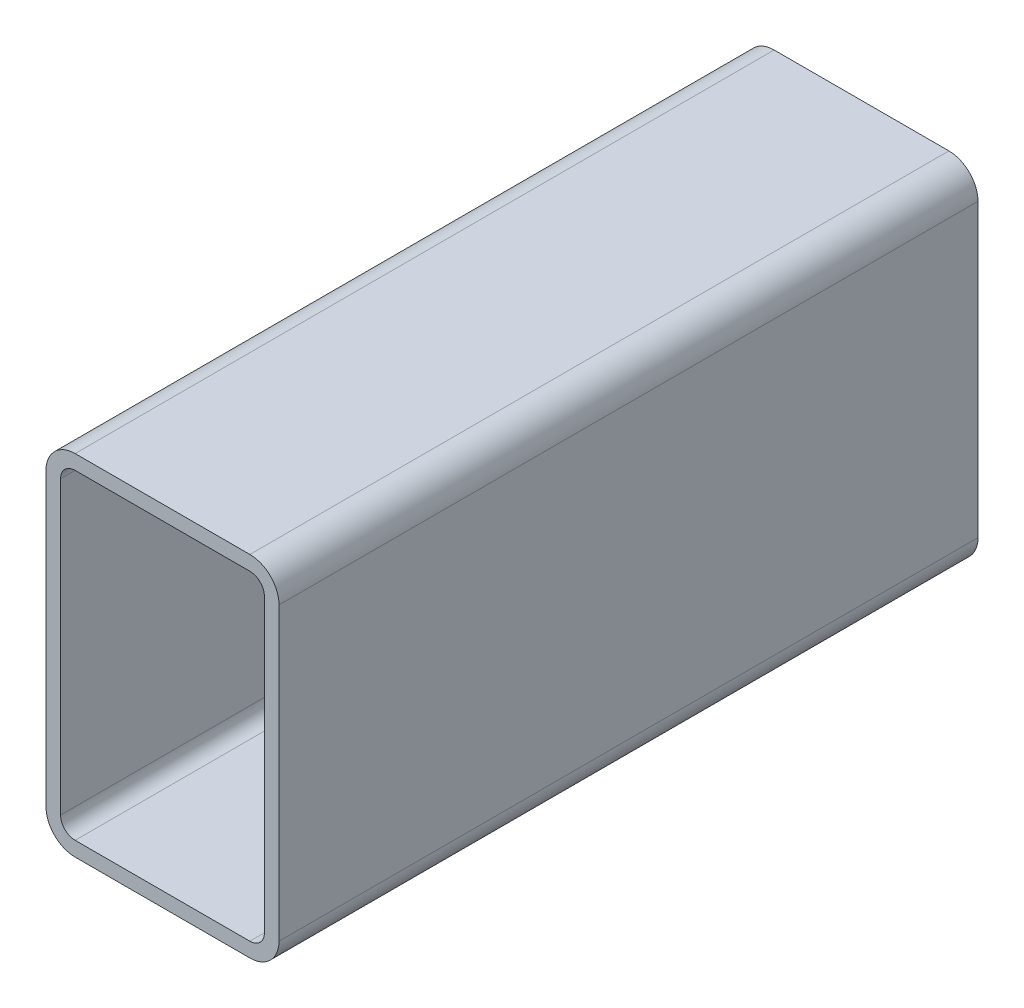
ISO-10303-21;
HEADER;
FILE_DESCRIPTION(('STEP AP214'),'2;1');
FILE_NAME('part.step','',(''),(''),'','','');
FILE_SCHEMA(('AUTOMOTIVE_DESIGN { 1 0 10303 214 1 1 1 1 }'));
ENDSEC;
DATA;
#1=APPLICATION_CONTEXT('core data for automotive mechanical design processes');
#2=APPLICATION_PROTOCOL_DEFINITION('international standard','automotive_design',2000,#1);
#3=PRODUCT_CONTEXT('',#1,'mechanical');
#4=PRODUCT('Part','Part','',(#3));
#5=PRODUCT_RELATED_PRODUCT_CATEGORY('part','',(#4));
#6=PRODUCT_DEFINITION_FORMATION('','',#4);
#7=PRODUCT_DEFINITION_CONTEXT('part definition',#1,'design');
#8=PRODUCT_DEFINITION('design','',#6,#7);
#9=PRODUCT_DEFINITION_SHAPE('','',#8);
#10=(LENGTH_UNIT() NAMED_UNIT(*) SI_UNIT(.MILLI.,.METRE.));
#11=(NAMED_UNIT(*) PLANE_ANGLE_UNIT() SI_UNIT($,.RADIAN.));
#12=(NAMED_UNIT(*) SI_UNIT($,.STERADIAN.) SOLID_ANGLE_UNIT());
#13=UNCERTAINTY_MEASURE_WITH_UNIT(LENGTH_MEASURE(1.E-05),#10,'distance_accuracy_value','');
#14=(GEOMETRIC_REPRESENTATION_CONTEXT(3) GLOBAL_UNCERTAINTY_ASSIGNED_CONTEXT((#13)) GLOBAL_UNIT_ASSIGNED_CONTEXT((#10,
#11,#12)) REPRESENTATION_CONTEXT('',''));
#15=CARTESIAN_POINT('',(0.,0.,0.));
#16=DIRECTION('',(0.,0.,1.));
#17=DIRECTION('',(1.,0.,0.));
#18=AXIS2_PLACEMENT_3D('',#15,#16,#17);
#19=CARTESIAN_POINT('',(14.3751778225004,141.711948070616,304.8));
#20=DIRECTION('',(0.,0.,1.));
#21=DIRECTION('',(1.,0.,0.));
#22=AXIS2_PLACEMENT_3D('',#19,#20,#21);
#23=PLANE('',#22);
#24=CARTESIAN_POINT('',(14.3751778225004,141.711948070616,304.8));
#25=DIRECTION('',(0.,0.,1.));
#26=DIRECTION('',(1.,0.,0.));
#27=AXIS2_PLACEMENT_3D('',#24,#25,#26);
#28=CIRCLE('',#27,12.7);
#29=CARTESIAN_POINT('',(14.3751778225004,154.411948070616,304.8));
#30=VERTEX_POINT('',#29);
#31=CARTESIAN_POINT('',(1.67517782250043,141.711948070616,304.8));
#32=VERTEX_POINT('',#31);
#33=EDGE_CURVE('E211',#30,#32,#28,.T.);
#34=ORIENTED_EDGE('',*,*,#33,.T.);
#35=DIRECTION('',(0.,-1.,0.));
#36=VECTOR('',#35,1.);
#37=CARTESIAN_POINT('',(1.67517782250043,14.7119480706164,304.8));
#38=LINE('',#37,#36);
#39=CARTESIAN_POINT('',(1.67517782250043,14.7119480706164,304.8));
#40=VERTEX_POINT('',#39);
#41=EDGE_CURVE('E214',#32,#40,#38,.T.);
#42=ORIENTED_EDGE('',*,*,#41,.T.);
#43=CARTESIAN_POINT('',(14.3751778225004,14.7119480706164,304.8));
#44=DIRECTION('',(0.,0.,1.));
#45=DIRECTION('',(1.,0.,0.));
#46=AXIS2_PLACEMENT_3D('',#43,#44,#45);
#47=CIRCLE('',#46,12.7);
#48=CARTESIAN_POINT('',(14.3751778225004,2.01194807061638,304.8));
#49=VERTEX_POINT('',#48);
#50=EDGE_CURVE('E217',#40,#49,#47,.T.);
#51=ORIENTED_EDGE('',*,*,#50,.T.);
#52=DIRECTION('',(1.,0.,0.));
#53=VECTOR('',#52,1.);
#54=CARTESIAN_POINT('',(90.5751778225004,2.01194807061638,304.8));
#55=LINE('',#54,#53);
#56=CARTESIAN_POINT('',(90.5751778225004,2.01194807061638,304.8));
#57=VERTEX_POINT('',#56);
#58=EDGE_CURVE('E219',#49,#57,#55,.T.);
#59=ORIENTED_EDGE('',*,*,#58,.T.);
#60=CARTESIAN_POINT('',(90.5751778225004,14.7119480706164,304.8));
#61=DIRECTION('',(0.,0.,1.));
#62=DIRECTION('',(1.,0.,0.));
#63=AXIS2_PLACEMENT_3D('',#60,#61,#62);
#64=CIRCLE('',#63,12.7);
#65=CARTESIAN_POINT('',(103.2751778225,14.7119480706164,304.8));
#66=VERTEX_POINT('',#65);
#67=EDGE_CURVE('E221',#57,#66,#64,.T.);
#68=ORIENTED_EDGE('',*,*,#67,.T.);
#69=DIRECTION('',(0.,1.,0.));
#70=VECTOR('',#69,1.);
#71=CARTESIAN_POINT('',(103.2751778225,141.711948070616,304.8));
#72=LINE('',#71,#70);
#73=CARTESIAN_POINT('',(103.2751778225,141.711948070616,304.8));
#74=VERTEX_POINT('',#73);
#75=EDGE_CURVE('E223',#66,#74,#72,.T.);
#76=ORIENTED_EDGE('',*,*,#75,.T.);
#77=CARTESIAN_POINT('',(90.5751778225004,141.711948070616,304.8));
#78=DIRECTION('',(0.,0.,1.));
#79=DIRECTION('',(1.,0.,0.));
#80=AXIS2_PLACEMENT_3D('',#77,#78,#79);
#81=CIRCLE('',#80,12.7);
#82=CARTESIAN_POINT('',(90.5751778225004,154.411948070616,304.8));
#83=VERTEX_POINT('',#82);
#84=EDGE_CURVE('E225',#74,#83,#81,.T.);
#85=ORIENTED_EDGE('',*,*,#84,.T.);
#86=DIRECTION('',(-1.,0.,0.));
#87=VECTOR('',#86,1.);
#88=CARTESIAN_POINT('',(14.3751778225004,154.411948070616,304.8));
#89=LINE('',#88,#87);
#90=EDGE_CURVE('E227',#83,#30,#89,.T.);
#91=ORIENTED_EDGE('',*,*,#90,.T.);
#92=EDGE_LOOP('',(#34,#42,#51,#59,#68,#76,#85,#91));
#93=FACE_BOUND('',#92,.T.);
#94=DIRECTION('',(0.,-1.,0.));
#95=VECTOR('',#94,1.);
#96=CARTESIAN_POINT('',(8.02517782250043,14.7119480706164,304.8));
#97=LINE('',#96,#95);
#98=CARTESIAN_POINT('',(8.02517782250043,141.711948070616,304.8));
#99=VERTEX_POINT('',#98);
#100=CARTESIAN_POINT('',(8.02517782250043,14.7119480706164,304.8));
#101=VERTEX_POINT('',#100);
#102=EDGE_CURVE('E154',#99,#101,#97,.T.);
#103=ORIENTED_EDGE('',*,*,#102,.F.);
#104=CARTESIAN_POINT('',(14.3751778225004,141.711948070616,304.8));
#105=DIRECTION('',(0.,0.,1.));
#106=DIRECTION('',(1.,0.,0.));
#107=AXIS2_PLACEMENT_3D('',#104,#105,#106);
#108=CIRCLE('',#107,6.35);
#109=CARTESIAN_POINT('',(14.3751778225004,148.061948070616,304.8));
#110=VERTEX_POINT('',#109);
#111=EDGE_CURVE('E146',#110,#99,#108,.T.);
#112=ORIENTED_EDGE('',*,*,#111,.F.);
#113=DIRECTION('',(-1.,0.,0.));
#114=VECTOR('',#113,1.);
#115=CARTESIAN_POINT('',(14.3751778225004,148.061948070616,304.8));
#116=LINE('',#115,#114);
#117=CARTESIAN_POINT('',(90.5751778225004,148.061948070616,304.8));
#118=VERTEX_POINT('',#117);
#119=EDGE_CURVE('E179',#118,#110,#116,.T.);
#120=ORIENTED_EDGE('',*,*,#119,.F.);
#121=CARTESIAN_POINT('',(90.5751778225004,141.711948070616,304.8));
#122=DIRECTION('',(0.,0.,1.));
#123=DIRECTION('',(1.,0.,0.));
#124=AXIS2_PLACEMENT_3D('',#121,#122,#123);
#125=CIRCLE('',#124,6.35);
#126=CARTESIAN_POINT('',(96.9251778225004,141.711948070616,304.8));
#127=VERTEX_POINT('',#126);
#128=EDGE_CURVE('E177',#127,#118,#125,.T.);
#129=ORIENTED_EDGE('',*,*,#128,.F.);
#130=DIRECTION('',(0.,1.,0.));
#131=VECTOR('',#130,1.);
#132=CARTESIAN_POINT('',(96.9251778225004,141.711948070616,304.8));
#133=LINE('',#132,#131);
#134=CARTESIAN_POINT('',(96.9251778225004,14.7119480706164,304.8));
#135=VERTEX_POINT('',#134);
#136=EDGE_CURVE('E175',#135,#127,#133,.T.);
#137=ORIENTED_EDGE('',*,*,#136,.F.);
#138=CARTESIAN_POINT('',(90.5751778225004,14.7119480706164,304.8));
#139=DIRECTION('',(0.,0.,1.));
#140=DIRECTION('',(1.,0.,0.));
#141=AXIS2_PLACEMENT_3D('',#138,#139,#140);
#142=CIRCLE('',#141,6.35000000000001);
#143=CARTESIAN_POINT('',(90.5751778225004,8.36194807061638,304.8));
#144=VERTEX_POINT('',#143);
#145=EDGE_CURVE('E173',#144,#135,#142,.T.);
#146=ORIENTED_EDGE('',*,*,#145,.F.);
#147=DIRECTION('',(1.,0.,0.));
#148=VECTOR('',#147,1.);
#149=CARTESIAN_POINT('',(90.5751778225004,8.36194807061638,304.8));
#150=LINE('',#149,#148);
#151=CARTESIAN_POINT('',(14.3751778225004,8.36194807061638,304.8));
#152=VERTEX_POINT('',#151);
#153=EDGE_CURVE('E169',#152,#144,#150,.T.);
#154=ORIENTED_EDGE('',*,*,#153,.F.);
#155=CARTESIAN_POINT('',(14.3751778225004,14.7119480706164,304.8));
#156=DIRECTION('',(0.,0.,1.));
#157=DIRECTION('',(1.,0.,0.));
#158=AXIS2_PLACEMENT_3D('',#155,#156,#157);
#159=CIRCLE('',#158,6.35);
#160=EDGE_CURVE('E167',#101,#152,#159,.T.);
#161=ORIENTED_EDGE('',*,*,#160,.F.);
#162=EDGE_LOOP('',(#103,#112,#120,#129,#137,#146,#154,#161));
#163=FACE_BOUND('',#162,.T.);
#164=ADVANCED_FACE('F33',(#93,#163),#23,.T.);
#165=CARTESIAN_POINT('',(14.3751778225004,141.711948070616,0.));
#166=DIRECTION('',(0.,0.,1.));
#167=DIRECTION('',(1.,0.,0.));
#168=AXIS2_PLACEMENT_3D('',#165,#166,#167);
#169=PLANE('',#168);
#170=CARTESIAN_POINT('',(14.3751778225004,141.711948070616,0.));
#171=DIRECTION('',(0.,0.,1.));
#172=DIRECTION('',(1.,0.,0.));
#173=AXIS2_PLACEMENT_3D('',#170,#171,#172);
#174=CIRCLE('',#173,12.7);
#175=CARTESIAN_POINT('',(14.3751778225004,154.411948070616,0.));
#176=VERTEX_POINT('',#175);
#177=CARTESIAN_POINT('',(1.67517782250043,141.711948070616,0.));
#178=VERTEX_POINT('',#177);
#179=EDGE_CURVE('E162',#176,#178,#174,.T.);
#180=ORIENTED_EDGE('',*,*,#179,.F.);
#181=DIRECTION('',(-1.,0.,0.));
#182=VECTOR('',#181,1.);
#183=CARTESIAN_POINT('',(14.3751778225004,154.411948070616,0.));
#184=LINE('',#183,#182);
#185=CARTESIAN_POINT('',(90.5751778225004,154.411948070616,0.));
#186=VERTEX_POINT('',#185);
#187=EDGE_CURVE('E215',#186,#176,#184,.T.);
#188=ORIENTED_EDGE('',*,*,#187,.F.);
#189=CARTESIAN_POINT('',(90.5751778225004,141.711948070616,0.));
#190=DIRECTION('',(0.,0.,1.));
#191=DIRECTION('',(1.,0.,0.));
#192=AXIS2_PLACEMENT_3D('',#189,#190,#191);
#193=CIRCLE('',#192,12.7);
#194=CARTESIAN_POINT('',(103.2751778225,141.711948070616,0.));
#195=VERTEX_POINT('',#194);
#196=EDGE_CURVE('E242',#195,#186,#193,.T.);
#197=ORIENTED_EDGE('',*,*,#196,.F.);
#198=DIRECTION('',(0.,1.,0.));
#199=VECTOR('',#198,1.);
#200=CARTESIAN_POINT('',(103.2751778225,141.711948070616,0.));
#201=LINE('',#200,#199);
#202=CARTESIAN_POINT('',(103.2751778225,14.7119480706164,0.));
#203=VERTEX_POINT('',#202);
#204=EDGE_CURVE('E240',#203,#195,#201,.T.);
#205=ORIENTED_EDGE('',*,*,#204,.F.);
#206=CARTESIAN_POINT('',(90.5751778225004,14.7119480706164,0.));
#207=DIRECTION('',(0.,0.,1.));
#208=DIRECTION('',(1.,0.,0.));
#209=AXIS2_PLACEMENT_3D('',#206,#207,#208);
#210=CIRCLE('',#209,12.7);
#211=CARTESIAN_POINT('',(90.5751778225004,2.01194807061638,0.));
#212=VERTEX_POINT('',#211);
#213=EDGE_CURVE('E238',#212,#203,#210,.T.);
#214=ORIENTED_EDGE('',*,*,#213,.F.);
#215=DIRECTION('',(1.,0.,0.));
#216=VECTOR('',#215,1.);
#217=CARTESIAN_POINT('',(90.5751778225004,2.01194807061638,0.));
#218=LINE('',#217,#216);
#219=CARTESIAN_POINT('',(14.3751778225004,2.01194807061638,0.));
#220=VERTEX_POINT('',#219);
#221=EDGE_CURVE('E236',#220,#212,#218,.T.);
#222=ORIENTED_EDGE('',*,*,#221,.F.);
#223=CARTESIAN_POINT('',(14.3751778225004,14.7119480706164,0.));
#224=DIRECTION('',(0.,0.,1.));
#225=DIRECTION('',(1.,0.,0.));
#226=AXIS2_PLACEMENT_3D('',#223,#224,#225);
#227=CIRCLE('',#226,12.7);
#228=CARTESIAN_POINT('',(1.67517782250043,14.7119480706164,0.));
#229=VERTEX_POINT('',#228);
#230=EDGE_CURVE('E234',#229,#220,#227,.T.);
#231=ORIENTED_EDGE('',*,*,#230,.F.);
#232=DIRECTION('',(0.,-1.,0.));
#233=VECTOR('',#232,1.);
#234=CARTESIAN_POINT('',(1.67517782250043,14.7119480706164,0.));
#235=LINE('',#234,#233);
#236=EDGE_CURVE('E232',#178,#229,#235,.T.);
#237=ORIENTED_EDGE('',*,*,#236,.F.);
#238=EDGE_LOOP('',(#180,#188,#197,#205,#214,#222,#231,#237));
#239=FACE_BOUND('',#238,.T.);
#240=CARTESIAN_POINT('',(14.3751778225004,141.711948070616,0.));
#241=DIRECTION('',(0.,0.,1.));
#242=DIRECTION('',(1.,0.,0.));
#243=AXIS2_PLACEMENT_3D('',#240,#241,#242);
#244=CIRCLE('',#243,6.35);
#245=CARTESIAN_POINT('',(14.3751778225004,148.061948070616,0.));
#246=VERTEX_POINT('',#245);
#247=CARTESIAN_POINT('',(8.02517782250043,141.711948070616,0.));
#248=VERTEX_POINT('',#247);
#249=EDGE_CURVE('E56',#246,#248,#244,.T.);
#250=ORIENTED_EDGE('',*,*,#249,.T.);
#251=DIRECTION('',(0.,-1.,0.));
#252=VECTOR('',#251,1.);
#253=CARTESIAN_POINT('',(8.02517782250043,14.7119480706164,0.));
#254=LINE('',#253,#252);
#255=CARTESIAN_POINT('',(8.02517782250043,14.7119480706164,0.));
#256=VERTEX_POINT('',#255);
#257=EDGE_CURVE('E161',#248,#256,#254,.T.);
#258=ORIENTED_EDGE('',*,*,#257,.T.);
#259=CARTESIAN_POINT('',(14.3751778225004,14.7119480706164,0.));
#260=DIRECTION('',(0.,0.,1.));
#261=DIRECTION('',(1.,0.,0.));
#262=AXIS2_PLACEMENT_3D('',#259,#260,#261);
#263=CIRCLE('',#262,6.35);
#264=CARTESIAN_POINT('',(14.3751778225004,8.36194807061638,0.));
#265=VERTEX_POINT('',#264);
#266=EDGE_CURVE('E183',#256,#265,#263,.T.);
#267=ORIENTED_EDGE('',*,*,#266,.T.);
#268=DIRECTION('',(1.,0.,0.));
#269=VECTOR('',#268,1.);
#270=CARTESIAN_POINT('',(90.5751778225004,8.36194807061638,0.));
#271=LINE('',#270,#269);
#272=CARTESIAN_POINT('',(90.5751778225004,8.36194807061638,0.));
#273=VERTEX_POINT('',#272);
#274=EDGE_CURVE('E186',#265,#273,#271,.T.);
#275=ORIENTED_EDGE('',*,*,#274,.T.);
#276=CARTESIAN_POINT('',(90.5751778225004,14.7119480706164,0.));
#277=DIRECTION('',(0.,0.,1.));
#278=DIRECTION('',(1.,0.,0.));
#279=AXIS2_PLACEMENT_3D('',#276,#277,#278);
#280=CIRCLE('',#279,6.35000000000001);
#281=CARTESIAN_POINT('',(96.9251778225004,14.7119480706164,0.));
#282=VERTEX_POINT('',#281);
#283=EDGE_CURVE('E189',#273,#282,#280,.T.);
#284=ORIENTED_EDGE('',*,*,#283,.T.);
#285=DIRECTION('',(0.,1.,0.));
#286=VECTOR('',#285,1.);
#287=CARTESIAN_POINT('',(96.9251778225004,141.711948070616,0.));
#288=LINE('',#287,#286);
#289=CARTESIAN_POINT('',(96.9251778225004,141.711948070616,0.));
#290=VERTEX_POINT('',#289);
#291=EDGE_CURVE('E192',#282,#290,#288,.T.);
#292=ORIENTED_EDGE('',*,*,#291,.T.);
#293=CARTESIAN_POINT('',(90.5751778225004,141.711948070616,0.));
#294=DIRECTION('',(0.,0.,1.));
#295=DIRECTION('',(1.,0.,0.));
#296=AXIS2_PLACEMENT_3D('',#293,#294,#295);
#297=CIRCLE('',#296,6.35);
#298=CARTESIAN_POINT('',(90.5751778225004,148.061948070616,0.));
#299=VERTEX_POINT('',#298);
#300=EDGE_CURVE('E195',#290,#299,#297,.T.);
#301=ORIENTED_EDGE('',*,*,#300,.T.);
#302=DIRECTION('',(-1.,0.,0.));
#303=VECTOR('',#302,1.);
#304=CARTESIAN_POINT('',(14.3751778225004,148.061948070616,0.));
#305=LINE('',#304,#303);
#306=EDGE_CURVE('E155',#299,#246,#305,.T.);
#307=ORIENTED_EDGE('',*,*,#306,.T.);
#308=EDGE_LOOP('',(#250,#258,#267,#275,#284,#292,#301,#307));
#309=FACE_BOUND('',#308,.T.);
#310=ADVANCED_FACE('F272',(#239,#309),#169,.F.);
#311=CARTESIAN_POINT('',(14.3751778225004,141.711948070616,304.8));
#312=DIRECTION('',(0.,0.,-1.));
#313=DIRECTION('',(-1.,0.,0.));
#314=AXIS2_PLACEMENT_3D('',#311,#312,#313);
#315=CYLINDRICAL_SURFACE('',#314,12.7);
#316=ORIENTED_EDGE('',*,*,#179,.T.);
#317=DIRECTION('',(0.,0.,-1.));
#318=VECTOR('',#317,1.);
#319=CARTESIAN_POINT('',(1.67517782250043,141.711948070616,304.8));
#320=LINE('',#319,#318);
#321=EDGE_CURVE('E11',#32,#178,#320,.T.);
#322=ORIENTED_EDGE('',*,*,#321,.F.);
#323=ORIENTED_EDGE('',*,*,#33,.F.);
#324=DIRECTION('',(0.,0.,-1.));
#325=VECTOR('',#324,1.);
#326=CARTESIAN_POINT('',(14.3751778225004,154.411948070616,304.8));
#327=LINE('',#326,#325);
#328=EDGE_CURVE('E229',#30,#176,#327,.T.);
#329=ORIENTED_EDGE('',*,*,#328,.T.);
#330=EDGE_LOOP('',(#316,#322,#323,#329));
#331=FACE_BOUND('',#330,.T.);
#332=ADVANCED_FACE('F35',(#331),#315,.T.);
#333=CARTESIAN_POINT('',(1.67517782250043,14.7119480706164,304.8));
#334=DIRECTION('',(1.,0.,0.));
#335=DIRECTION('',(0.,0.,-1.));
#336=AXIS2_PLACEMENT_3D('',#333,#334,#335);
#337=PLANE('',#336);
#338=ORIENTED_EDGE('',*,*,#236,.T.);
#339=DIRECTION('',(0.,0.,-1.));
#340=VECTOR('',#339,1.);
#341=CARTESIAN_POINT('',(1.67517782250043,14.7119480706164,304.8));
#342=LINE('',#341,#340);
#343=EDGE_CURVE('E41',#40,#229,#342,.T.);
#344=ORIENTED_EDGE('',*,*,#343,.F.);
#345=ORIENTED_EDGE('',*,*,#41,.F.);
#346=ORIENTED_EDGE('',*,*,#321,.T.);
#347=EDGE_LOOP('',(#338,#344,#345,#346));
#348=FACE_BOUND('',#347,.T.);
#349=ADVANCED_FACE('F289',(#348),#337,.F.);
#350=CARTESIAN_POINT('',(14.3751778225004,14.7119480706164,304.8));
#351=DIRECTION('',(0.,0.,-1.));
#352=DIRECTION('',(-1.,0.,0.));
#353=AXIS2_PLACEMENT_3D('',#350,#351,#352);
#354=CYLINDRICAL_SURFACE('',#353,12.7);
#355=ORIENTED_EDGE('',*,*,#230,.T.);
#356=DIRECTION('',(0.,0.,-1.));
#357=VECTOR('',#356,1.);
#358=CARTESIAN_POINT('',(14.3751778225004,2.01194807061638,304.8));
#359=LINE('',#358,#357);
#360=EDGE_CURVE('E259',#49,#220,#359,.T.);
#361=ORIENTED_EDGE('',*,*,#360,.F.);
#362=ORIENTED_EDGE('',*,*,#50,.F.);
#363=ORIENTED_EDGE('',*,*,#343,.T.);
#364=EDGE_LOOP('',(#355,#361,#362,#363));
#365=FACE_BOUND('',#364,.T.);
#366=ADVANCED_FACE('F266',(#365),#354,.T.);
#367=CARTESIAN_POINT('',(90.5751778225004,2.01194807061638,304.8));
#368=DIRECTION('',(0.,1.,0.));
#369=DIRECTION('',(0.,0.,1.));
#370=AXIS2_PLACEMENT_3D('',#367,#368,#369);
#371=PLANE('',#370);
#372=ORIENTED_EDGE('',*,*,#221,.T.);
#373=DIRECTION('',(0.,0.,-1.));
#374=VECTOR('',#373,1.);
#375=CARTESIAN_POINT('',(90.5751778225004,2.01194807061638,304.8));
#376=LINE('',#375,#374);
#377=EDGE_CURVE('E256',#57,#212,#376,.T.);
#378=ORIENTED_EDGE('',*,*,#377,.F.);
#379=ORIENTED_EDGE('',*,*,#58,.F.);
#380=ORIENTED_EDGE('',*,*,#360,.T.);
#381=EDGE_LOOP('',(#372,#378,#379,#380));
#382=FACE_BOUND('',#381,.T.);
#383=ADVANCED_FACE('F278',(#382),#371,.F.);
#384=CARTESIAN_POINT('',(90.5751778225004,14.7119480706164,304.8));
#385=DIRECTION('',(0.,0.,-1.));
#386=DIRECTION('',(-1.,0.,0.));
#387=AXIS2_PLACEMENT_3D('',#384,#385,#386);
#388=CYLINDRICAL_SURFACE('',#387,12.7);
#389=ORIENTED_EDGE('',*,*,#213,.T.);
#390=DIRECTION('',(0.,0.,-1.));
#391=VECTOR('',#390,1.);
#392=CARTESIAN_POINT('',(103.2751778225,14.7119480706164,304.8));
#393=LINE('',#392,#391);
#394=EDGE_CURVE('E253',#66,#203,#393,.T.);
#395=ORIENTED_EDGE('',*,*,#394,.F.);
#396=ORIENTED_EDGE('',*,*,#67,.F.);
#397=ORIENTED_EDGE('',*,*,#377,.T.);
#398=EDGE_LOOP('',(#389,#395,#396,#397));
#399=FACE_BOUND('',#398,.T.);
#400=ADVANCED_FACE('F282',(#399),#388,.T.);
#401=CARTESIAN_POINT('',(103.2751778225,141.711948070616,304.8));
#402=DIRECTION('',(-1.,0.,0.));
#403=DIRECTION('',(0.,0.,1.));
#404=AXIS2_PLACEMENT_3D('',#401,#402,#403);
#405=PLANE('',#404);
#406=ORIENTED_EDGE('',*,*,#204,.T.);
#407=DIRECTION('',(0.,0.,-1.));
#408=VECTOR('',#407,1.);
#409=CARTESIAN_POINT('',(103.2751778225,141.711948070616,304.8));
#410=LINE('',#409,#408);
#411=EDGE_CURVE('E250',#74,#195,#410,.T.);
#412=ORIENTED_EDGE('',*,*,#411,.F.);
#413=ORIENTED_EDGE('',*,*,#75,.F.);
#414=ORIENTED_EDGE('',*,*,#394,.T.);
#415=EDGE_LOOP('',(#406,#412,#413,#414));
#416=FACE_BOUND('',#415,.T.);
#417=ADVANCED_FACE('F302',(#416),#405,.F.);
#418=CARTESIAN_POINT('',(90.5751778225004,141.711948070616,304.8));
#419=DIRECTION('',(0.,0.,-1.));
#420=DIRECTION('',(-1.,0.,0.));
#421=AXIS2_PLACEMENT_3D('',#418,#419,#420);
#422=CYLINDRICAL_SURFACE('',#421,12.7);
#423=ORIENTED_EDGE('',*,*,#196,.T.);
#424=DIRECTION('',(0.,0.,-1.));
#425=VECTOR('',#424,1.);
#426=CARTESIAN_POINT('',(90.5751778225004,154.411948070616,304.8));
#427=LINE('',#426,#425);
#428=EDGE_CURVE('E247',#83,#186,#427,.T.);
#429=ORIENTED_EDGE('',*,*,#428,.F.);
#430=ORIENTED_EDGE('',*,*,#84,.F.);
#431=ORIENTED_EDGE('',*,*,#411,.T.);
#432=EDGE_LOOP('',(#423,#429,#430,#431));
#433=FACE_BOUND('',#432,.T.);
#434=ADVANCED_FACE('F300',(#433),#422,.T.);
#435=CARTESIAN_POINT('',(14.3751778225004,154.411948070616,304.8));
#436=DIRECTION('',(0.,-1.,0.));
#437=DIRECTION('',(0.,0.,-1.));
#438=AXIS2_PLACEMENT_3D('',#435,#436,#437);
#439=PLANE('',#438);
#440=ORIENTED_EDGE('',*,*,#187,.T.);
#441=ORIENTED_EDGE('',*,*,#328,.F.);
#442=ORIENTED_EDGE('',*,*,#90,.F.);
#443=ORIENTED_EDGE('',*,*,#428,.T.);
#444=EDGE_LOOP('',(#440,#441,#442,#443));
#445=FACE_BOUND('',#444,.T.);
#446=ADVANCED_FACE('F295',(#445),#439,.F.);
#447=CARTESIAN_POINT('',(14.3751778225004,141.711948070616,304.8));
#448=DIRECTION('',(0.,0.,-1.));
#449=DIRECTION('',(-1.,0.,0.));
#450=AXIS2_PLACEMENT_3D('',#447,#448,#449);
#451=CYLINDRICAL_SURFACE('',#450,6.35);
#452=ORIENTED_EDGE('',*,*,#249,.F.);
#453=DIRECTION('',(0.,0.,-1.));
#454=VECTOR('',#453,1.);
#455=CARTESIAN_POINT('',(14.3751778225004,148.061948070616,304.8));
#456=LINE('',#455,#454);
#457=EDGE_CURVE('E150',#110,#246,#456,.T.);
#458=ORIENTED_EDGE('',*,*,#457,.F.);
#459=ORIENTED_EDGE('',*,*,#111,.T.);
#460=DIRECTION('',(0.,0.,-1.));
#461=VECTOR('',#460,1.);
#462=CARTESIAN_POINT('',(8.02517782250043,141.711948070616,304.8));
#463=LINE('',#462,#461);
#464=EDGE_CURVE('E149',#99,#248,#463,.T.);
#465=ORIENTED_EDGE('',*,*,#464,.T.);
#466=EDGE_LOOP('',(#452,#458,#459,#465));
#467=FACE_BOUND('',#466,.T.);
#468=ADVANCED_FACE('F148',(#467),#451,.F.);
#469=CARTESIAN_POINT('',(8.02517782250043,14.7119480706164,304.8));
#470=DIRECTION('',(1.,0.,0.));
#471=DIRECTION('',(0.,0.,-1.));
#472=AXIS2_PLACEMENT_3D('',#469,#470,#471);
#473=PLANE('',#472);
#474=ORIENTED_EDGE('',*,*,#257,.F.);
#475=ORIENTED_EDGE('',*,*,#464,.F.);
#476=ORIENTED_EDGE('',*,*,#102,.T.);
#477=DIRECTION('',(0.,0.,-1.));
#478=VECTOR('',#477,1.);
#479=CARTESIAN_POINT('',(8.02517782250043,14.7119480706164,304.8));
#480=LINE('',#479,#478);
#481=EDGE_CURVE('E163',#101,#256,#480,.T.);
#482=ORIENTED_EDGE('',*,*,#481,.T.);
#483=EDGE_LOOP('',(#474,#475,#476,#482));
#484=FACE_BOUND('',#483,.T.);
#485=ADVANCED_FACE('F158',(#484),#473,.T.);
#486=CARTESIAN_POINT('',(14.3751778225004,14.7119480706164,304.8));
#487=DIRECTION('',(0.,0.,-1.));
#488=DIRECTION('',(-1.,0.,0.));
#489=AXIS2_PLACEMENT_3D('',#486,#487,#488);
#490=CYLINDRICAL_SURFACE('',#489,6.35);
#491=ORIENTED_EDGE('',*,*,#266,.F.);
#492=ORIENTED_EDGE('',*,*,#481,.F.);
#493=ORIENTED_EDGE('',*,*,#160,.T.);
#494=DIRECTION('',(0.,0.,-1.));
#495=VECTOR('',#494,1.);
#496=CARTESIAN_POINT('',(14.3751778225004,8.36194807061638,304.8));
#497=LINE('',#496,#495);
#498=EDGE_CURVE('E208',#152,#265,#497,.T.);
#499=ORIENTED_EDGE('',*,*,#498,.T.);
#500=EDGE_LOOP('',(#491,#492,#493,#499));
#501=FACE_BOUND('',#500,.T.);
#502=ADVANCED_FACE('F327',(#501),#490,.F.);
#503=CARTESIAN_POINT('',(90.5751778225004,8.36194807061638,304.8));
#504=DIRECTION('',(0.,1.,0.));
#505=DIRECTION('',(0.,0.,1.));
#506=AXIS2_PLACEMENT_3D('',#503,#504,#505);
#507=PLANE('',#506);
#508=ORIENTED_EDGE('',*,*,#274,.F.);
#509=ORIENTED_EDGE('',*,*,#498,.F.);
#510=ORIENTED_EDGE('',*,*,#153,.T.);
#511=DIRECTION('',(0.,0.,-1.));
#512=VECTOR('',#511,1.);
#513=CARTESIAN_POINT('',(90.5751778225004,8.36194807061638,304.8));
#514=LINE('',#513,#512);
#515=EDGE_CURVE('E206',#144,#273,#514,.T.);
#516=ORIENTED_EDGE('',*,*,#515,.T.);
#517=EDGE_LOOP('',(#508,#509,#510,#516));
#518=FACE_BOUND('',#517,.T.);
#519=ADVANCED_FACE('F331',(#518),#507,.T.);
#520=CARTESIAN_POINT('',(90.5751778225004,14.7119480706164,304.8));
#521=DIRECTION('',(0.,0.,-1.));
#522=DIRECTION('',(-1.,0.,0.));
#523=AXIS2_PLACEMENT_3D('',#520,#521,#522);
#524=CYLINDRICAL_SURFACE('',#523,6.35000000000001);
#525=ORIENTED_EDGE('',*,*,#283,.F.);
#526=ORIENTED_EDGE('',*,*,#515,.F.);
#527=ORIENTED_EDGE('',*,*,#145,.T.);
#528=DIRECTION('',(0.,0.,-1.));
#529=VECTOR('',#528,1.);
#530=CARTESIAN_POINT('',(96.9251778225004,14.7119480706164,304.8));
#531=LINE('',#530,#529);
#532=EDGE_CURVE('E204',#135,#282,#531,.T.);
#533=ORIENTED_EDGE('',*,*,#532,.T.);
#534=EDGE_LOOP('',(#525,#526,#527,#533));
#535=FACE_BOUND('',#534,.T.);
#536=ADVANCED_FACE('F337',(#535),#524,.F.);
#537=CARTESIAN_POINT('',(96.9251778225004,141.711948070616,304.8));
#538=DIRECTION('',(-1.,0.,0.));
#539=DIRECTION('',(0.,0.,1.));
#540=AXIS2_PLACEMENT_3D('',#537,#538,#539);
#541=PLANE('',#540);
#542=ORIENTED_EDGE('',*,*,#291,.F.);
#543=ORIENTED_EDGE('',*,*,#532,.F.);
#544=ORIENTED_EDGE('',*,*,#136,.T.);
#545=DIRECTION('',(0.,0.,-1.));
#546=VECTOR('',#545,1.);
#547=CARTESIAN_POINT('',(96.9251778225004,141.711948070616,304.8));
#548=LINE('',#547,#546);
#549=EDGE_CURVE('E202',#127,#290,#548,.T.);
#550=ORIENTED_EDGE('',*,*,#549,.T.);
#551=EDGE_LOOP('',(#542,#543,#544,#550));
#552=FACE_BOUND('',#551,.T.);
#553=ADVANCED_FACE('F341',(#552),#541,.T.);
#554=CARTESIAN_POINT('',(90.5751778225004,141.711948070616,304.8));
#555=DIRECTION('',(0.,0.,-1.));
#556=DIRECTION('',(-1.,0.,0.));
#557=AXIS2_PLACEMENT_3D('',#554,#555,#556);
#558=CYLINDRICAL_SURFACE('',#557,6.35);
#559=ORIENTED_EDGE('',*,*,#300,.F.);
#560=ORIENTED_EDGE('',*,*,#549,.F.);
#561=ORIENTED_EDGE('',*,*,#128,.T.);
#562=DIRECTION('',(0.,0.,-1.));
#563=VECTOR('',#562,1.);
#564=CARTESIAN_POINT('',(90.5751778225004,148.061948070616,304.8));
#565=LINE('',#564,#563);
#566=EDGE_CURVE('E48',#118,#299,#565,.T.);
#567=ORIENTED_EDGE('',*,*,#566,.T.);
#568=EDGE_LOOP('',(#559,#560,#561,#567));
#569=FACE_BOUND('',#568,.T.);
#570=ADVANCED_FACE('F345',(#569),#558,.F.);
#571=CARTESIAN_POINT('',(14.3751778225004,148.061948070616,304.8));
#572=DIRECTION('',(0.,-1.,0.));
#573=DIRECTION('',(0.,0.,-1.));
#574=AXIS2_PLACEMENT_3D('',#571,#572,#573);
#575=PLANE('',#574);
#576=ORIENTED_EDGE('',*,*,#306,.F.);
#577=ORIENTED_EDGE('',*,*,#566,.F.);
#578=ORIENTED_EDGE('',*,*,#119,.T.);
#579=ORIENTED_EDGE('',*,*,#457,.T.);
#580=EDGE_LOOP('',(#576,#577,#578,#579));
#581=FACE_BOUND('',#580,.T.);
#582=ADVANCED_FACE('F349',(#581),#575,.T.);
#583=CLOSED_SHELL('',(#164,#310,#332,#349,#366,#383,#400,#417,#434,#446,#468,#485,#502,#519,
#536,#553,#570,#582));
#584=MANIFOLD_SOLID_BREP('B2',#583);
#585=ADVANCED_BREP_SHAPE_REPRESENTATION('',(#18,#584),#14);
#586=SHAPE_DEFINITION_REPRESENTATION(#9,#585);
ENDSEC;
END-ISO-10303-21;
